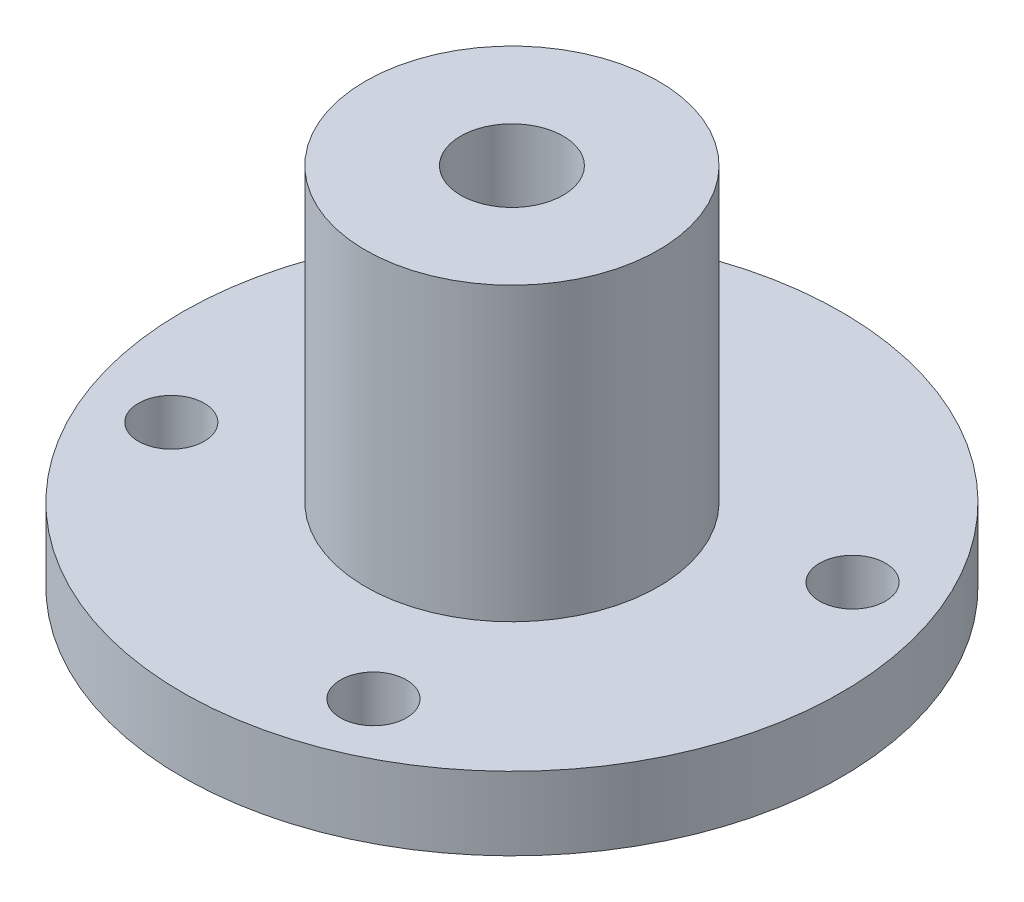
from build123d import *

# Parameters (mm, degrees)
TROU_TARAUD_M161_D            = 14
DIAM_TRE_DU_PER_AGE_9_0_9_1_D = 9
R_P_TITION_CIRCULAIRE1_COUNT  = 4


with BuildPart() as part:
    # Esquisse1 → R_volution1 (revolve)
    with BuildSketch(Plane.XY, mode=Mode.PRIVATE) as r_volution1_sk:
        Polygon((0, 49.8), (0, 10), (15, 10), (15, 0), (45, 0), (45, 10), (20, 10), (20, 49.8), align=None)
    revolve(r_volution1_sk.sketch.rotate(Axis((0, 49.8, 0), (0, -1, 0)), 180), axis=Axis((0, 49.8, 0), (0, -1, 0)))

    # Trou taraud_ M161 (through all)
    with Locations(Plane(origin=(0, 49.8, 0), x_dir=(-1, 0, 0), z_dir=(0, 1, 0))):
        with Locations((0, 0)):
            Hole(TROU_TARAUD_M161_D / 2)

    # Diam_tre du per_age _9.0 _9_1 (through all)
    with Locations(Plane(origin=(0, 10, 0), x_dir=(-1, 0, 0), z_dir=(0, 1, 0))):
        with Locations((13.80098421, -32.707534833)):
            diam_tre_du_per_age_9_0_9_1 = Hole(DIAM_TRE_DU_PER_AGE_9_0_9_1_D / 2)

    # R_p_tition circulaire1: Diam_tre du per_age _9.0 _9_1 ×4 about axis
    r_p_tition_circulaire1_axis = Axis((0, 0, 0), (0, 1, 0))
    for i in range(1, R_P_TITION_CIRCULAIRE1_COUNT):
        add(diam_tre_du_per_age_9_0_9_1.rotate(r_p_tition_circulaire1_axis, i * 360 / R_P_TITION_CIRCULAIRE1_COUNT), mode=Mode.SUBTRACT)


solid = part.part
